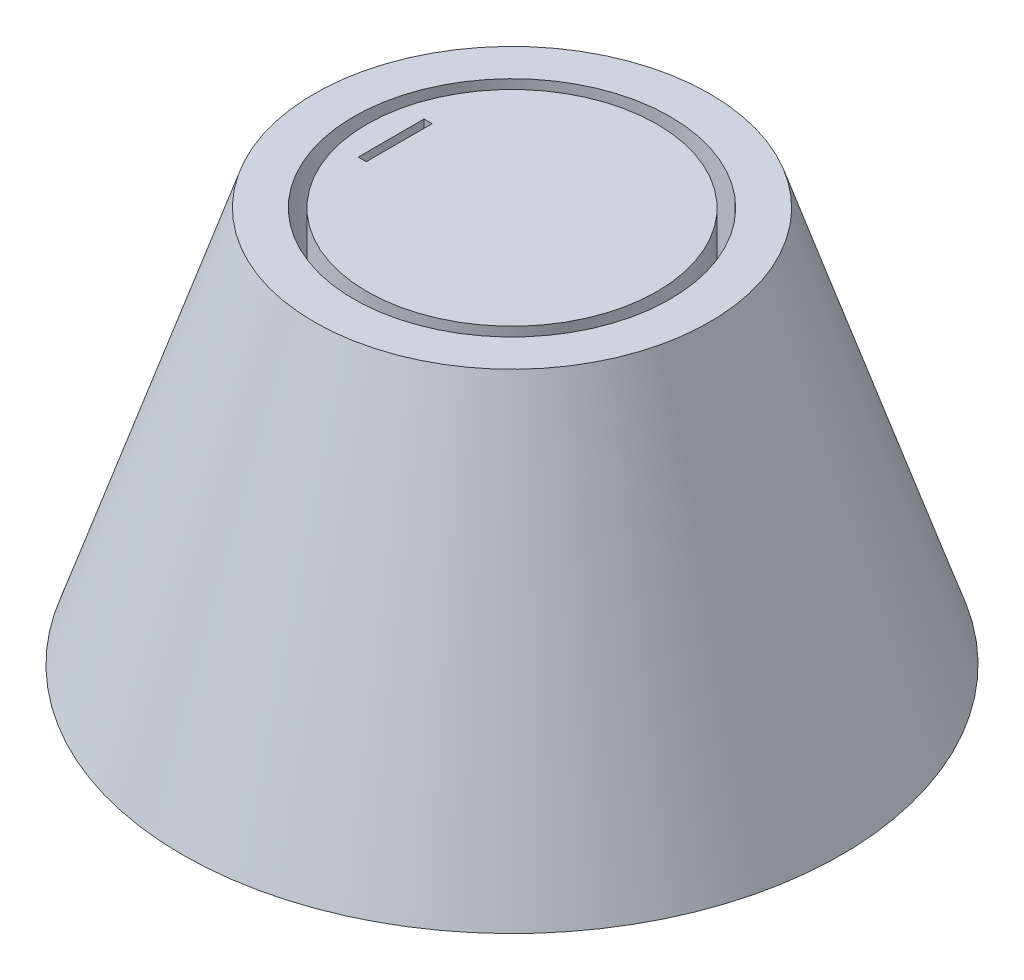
from build123d import *

# Parameters (mm, degrees)
SKETCH5_W          = 0.61
SKETCH5_H          = 5
CUT_EXTRUDE1_DEPTH = 10


with BuildPart() as part:
    # Sketch4 → Revolve1 (revolve)
    with BuildSketch(Plane.XY, mode=Mode.PRIVATE) as revolve1_sk:
        Polygon((0, 0), (-11, 0), (-11, -10), (-12, -10), (-12, 0), (-15, 0), (-25, -30), (0, -30), align=None)
    revolve(revolve1_sk.sketch.rotate(Axis((0, -30, 0), (0, 1, 0)), 270), axis=Axis((0, -30, 0), (0, 1, 0)))

    # Sketch5 → Cut-Extrude1 (cut)
    with BuildSketch(Plane(origin=(0, 0, 0), x_dir=(1, 0, 0), z_dir=(0, 1, 0))):
        with Locations((-8.865, 0)):
            Rectangle(SKETCH5_W, SKETCH5_H)
    extrude(amount=-CUT_EXTRUDE1_DEPTH, mode=Mode.SUBTRACT)


solid = part.part
